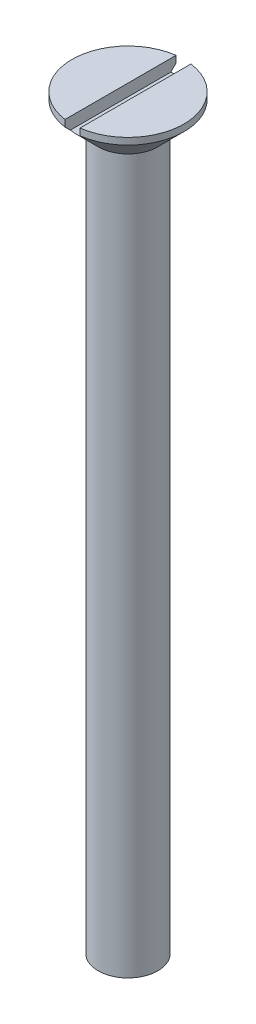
ISO-10303-21;
HEADER;
FILE_DESCRIPTION(('STEP AP214'),'2;1');
FILE_NAME('part.step','',(''),(''),'','','');
FILE_SCHEMA(('AUTOMOTIVE_DESIGN { 1 0 10303 214 1 1 1 1 }'));
ENDSEC;
DATA;
#1=APPLICATION_CONTEXT('core data for automotive mechanical design processes');
#2=APPLICATION_PROTOCOL_DEFINITION('international standard','automotive_design',2000,#1);
#3=PRODUCT_CONTEXT('',#1,'mechanical');
#4=PRODUCT('Part','Part','',(#3));
#5=PRODUCT_RELATED_PRODUCT_CATEGORY('part','',(#4));
#6=PRODUCT_DEFINITION_FORMATION('','',#4);
#7=PRODUCT_DEFINITION_CONTEXT('part definition',#1,'design');
#8=PRODUCT_DEFINITION('design','',#6,#7);
#9=PRODUCT_DEFINITION_SHAPE('','',#8);
#10=(LENGTH_UNIT() NAMED_UNIT(*) SI_UNIT(.MILLI.,.METRE.));
#11=(NAMED_UNIT(*) PLANE_ANGLE_UNIT() SI_UNIT($,.RADIAN.));
#12=(NAMED_UNIT(*) SI_UNIT($,.STERADIAN.) SOLID_ANGLE_UNIT());
#13=UNCERTAINTY_MEASURE_WITH_UNIT(LENGTH_MEASURE(1.E-05),#10,'distance_accuracy_value','');
#14=(GEOMETRIC_REPRESENTATION_CONTEXT(3) GLOBAL_UNCERTAINTY_ASSIGNED_CONTEXT((#13)) GLOBAL_UNIT_ASSIGNED_CONTEXT((#10,
#11,#12)) REPRESENTATION_CONTEXT('',''));
#15=CARTESIAN_POINT('',(0.,0.,0.));
#16=DIRECTION('',(0.,0.,1.));
#17=DIRECTION('',(1.,0.,0.));
#18=AXIS2_PLACEMENT_3D('',#15,#16,#17);
#19=CARTESIAN_POINT('',(0.,50.,0.));
#20=DIRECTION('',(0.,1.,0.));
#21=DIRECTION('',(-1.,0.,0.));
#22=AXIS2_PLACEMENT_3D('',#19,#20,#21);
#23=CYLINDRICAL_SURFACE('',#22,3.75);
#24=DIRECTION('',(0.,1.,0.));
#25=VECTOR('',#24,1.);
#26=CARTESIAN_POINT('',(-0.500000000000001,50.,3.71651718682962));
#27=LINE('',#26,#25);
#28=CARTESIAN_POINT('',(-0.500000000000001,50.,3.71651718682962));
#29=VERTEX_POINT('',#28);
#30=CARTESIAN_POINT('',(-0.500000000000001,49.55,3.71651718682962));
#31=VERTEX_POINT('',#30);
#32=EDGE_CURVE('E59',#29,#31,#27,.F.);
#33=ORIENTED_EDGE('',*,*,#32,.F.);
#34=CARTESIAN_POINT('',(0.,50.,0.));
#35=DIRECTION('',(0.,1.,0.));
#36=DIRECTION('',(-1.,0.,0.));
#37=AXIS2_PLACEMENT_3D('',#34,#35,#36);
#38=CIRCLE('',#37,3.75);
#39=CARTESIAN_POINT('',(-0.500000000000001,50.,-3.71651718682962));
#40=VERTEX_POINT('',#39);
#41=EDGE_CURVE('E107',#40,#29,#38,.T.);
#42=ORIENTED_EDGE('',*,*,#41,.F.);
#43=DIRECTION('',(0.,1.,0.));
#44=VECTOR('',#43,1.);
#45=CARTESIAN_POINT('',(-0.500000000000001,50.,-3.71651718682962));
#46=LINE('',#45,#44);
#47=CARTESIAN_POINT('',(-0.500000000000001,49.55,-3.71651718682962));
#48=VERTEX_POINT('',#47);
#49=EDGE_CURVE('E140',#48,#40,#46,.T.);
#50=ORIENTED_EDGE('',*,*,#49,.F.);
#51=CARTESIAN_POINT('',(0.,49.55,0.));
#52=DIRECTION('',(0.,1.,0.));
#53=DIRECTION('',(-1.,0.,0.));
#54=AXIS2_PLACEMENT_3D('',#51,#52,#53);
#55=CIRCLE('',#54,3.75);
#56=EDGE_CURVE('E106',#48,#31,#55,.T.);
#57=ORIENTED_EDGE('',*,*,#56,.T.);
#58=EDGE_LOOP('',(#33,#42,#50,#57));
#59=FACE_BOUND('',#58,.T.);
#60=ADVANCED_FACE('F36',(#59),#23,.T.);
#61=CARTESIAN_POINT('',(-3.75,50.,0.));
#62=DIRECTION('',(0.,1.,0.));
#63=DIRECTION('',(-1.,0.,0.));
#64=AXIS2_PLACEMENT_3D('',#61,#62,#63);
#65=PLANE('',#64);
#66=DIRECTION('',(0.,0.,1.));
#67=VECTOR('',#66,1.);
#68=CARTESIAN_POINT('',(-0.500000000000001,50.,0.));
#69=LINE('',#68,#67);
#70=EDGE_CURVE('E93',#40,#29,#69,.T.);
#71=ORIENTED_EDGE('',*,*,#70,.F.);
#72=ORIENTED_EDGE('',*,*,#41,.T.);
#73=EDGE_LOOP('',(#71,#72));
#74=FACE_BOUND('',#73,.T.);
#75=ADVANCED_FACE('F156',(#74),#65,.T.);
#76=CARTESIAN_POINT('',(0.,0.,0.));
#77=DIRECTION('',(0.,-1.,0.));
#78=DIRECTION('',(1.,0.,0.));
#79=AXIS2_PLACEMENT_3D('',#76,#77,#78);
#80=PLANE('',#79);
#81=CARTESIAN_POINT('',(0.,0.,0.));
#82=DIRECTION('',(0.,1.,0.));
#83=DIRECTION('',(-1.,0.,0.));
#84=AXIS2_PLACEMENT_3D('',#81,#82,#83);
#85=CIRCLE('',#84,2.);
#86=CARTESIAN_POINT('',(-2.,0.,0.));
#87=VERTEX_POINT('',#86);
#88=EDGE_CURVE('E94',#87,#87,#85,.T.);
#89=ORIENTED_EDGE('',*,*,#88,.F.);
#90=EDGE_LOOP('',(#89));
#91=FACE_BOUND('',#90,.T.);
#92=ADVANCED_FACE('F38',(#91),#80,.T.);
#93=CARTESIAN_POINT('',(0.,50.,0.));
#94=DIRECTION('',(0.,1.,0.));
#95=DIRECTION('',(-1.,0.,0.));
#96=AXIS2_PLACEMENT_3D('',#93,#94,#95);
#97=CYLINDRICAL_SURFACE('',#96,1.99999999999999);
#98=ORIENTED_EDGE('',*,*,#88,.T.);
#99=EDGE_LOOP('',(#98));
#100=FACE_BOUND('',#99,.T.);
#101=CARTESIAN_POINT('',(0.,47.8,0.));
#102=DIRECTION('',(0.,1.,0.));
#103=DIRECTION('',(-1.,0.,0.));
#104=AXIS2_PLACEMENT_3D('',#101,#102,#103);
#105=CIRCLE('',#104,1.99999999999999);
#106=CARTESIAN_POINT('',(-1.99999999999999,47.8,0.));
#107=VERTEX_POINT('',#106);
#108=EDGE_CURVE('E116',#107,#107,#105,.T.);
#109=ORIENTED_EDGE('',*,*,#108,.F.);
#110=EDGE_LOOP('',(#109));
#111=FACE_BOUND('',#110,.T.);
#112=ADVANCED_FACE('F161',(#100,#111),#97,.T.);
#113=CARTESIAN_POINT('',(0.,49.55,0.));
#114=DIRECTION('',(0.,1.,0.));
#115=DIRECTION('',(-1.,0.,0.));
#116=AXIS2_PLACEMENT_3D('',#113,#114,#115);
#117=CONICAL_SURFACE('',#116,3.75,0.785398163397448);
#118=CARTESIAN_POINT('',(-0.500000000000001,54.0550973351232,8.23994126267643));
#119=CARTESIAN_POINT('',(-0.500000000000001,53.7744963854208,7.95882009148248));
#120=CARTESIAN_POINT('',(-0.500000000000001,53.4939179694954,7.67767641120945));
#121=CARTESIAN_POINT('',(-0.500000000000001,52.9328309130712,7.11531119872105));
#122=CARTESIAN_POINT('',(-0.500000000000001,52.6523222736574,6.83408966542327));
#123=CARTESIAN_POINT('',(-0.500000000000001,52.0913157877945,6.27145196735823));
#124=CARTESIAN_POINT('',(-0.500000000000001,51.810817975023,5.99003576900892));
#125=CARTESIAN_POINT('',(-0.500000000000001,51.2499812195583,5.42705309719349));
#126=CARTESIAN_POINT('',(-0.500000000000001,50.9696422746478,5.14548662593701));
#127=CARTESIAN_POINT('',(-0.500000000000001,50.4011601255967,4.57400822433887));
#128=CARTESIAN_POINT('',(-0.500000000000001,50.1130242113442,4.28408904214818));
#129=CARTESIAN_POINT('',(-0.500000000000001,49.5371989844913,3.70378260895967));
#130=CARTESIAN_POINT('',(-0.500000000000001,49.249509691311,3.41339533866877));
#131=CARTESIAN_POINT('',(-0.500000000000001,48.8187346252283,2.97712474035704));
#132=CARTESIAN_POINT('',(-0.500000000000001,48.6752843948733,2.83160153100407));
#133=CARTESIAN_POINT('',(-0.500000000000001,48.3887721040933,2.54016851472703));
#134=CARTESIAN_POINT('',(-0.500000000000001,48.2457100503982,2.39425870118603));
#135=CARTESIAN_POINT('',(-0.500000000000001,47.9602376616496,2.10182340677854));
#136=CARTESIAN_POINT('',(-0.500000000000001,47.8178272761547,1.95529797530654));
#137=CARTESIAN_POINT('',(-0.500000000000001,47.6051397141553,1.73461874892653));
#138=CARTESIAN_POINT('',(-0.500000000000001,47.5343995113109,1.6609115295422));
#139=CARTESIAN_POINT('',(-0.500000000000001,47.3933772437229,1.51306045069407));
#140=CARTESIAN_POINT('',(-0.500000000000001,47.3230951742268,1.43891659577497));
#141=CARTESIAN_POINT('',(-0.500000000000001,47.2154772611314,1.32429753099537));
#142=CARTESIAN_POINT('',(-0.500000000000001,47.1778899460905,1.28405855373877));
#143=CARTESIAN_POINT('',(-0.500000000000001,47.1029855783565,1.2033283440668));
#144=CARTESIAN_POINT('',(-0.500000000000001,47.0656685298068,1.16283710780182));
#145=CARTESIAN_POINT('',(-0.500000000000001,46.9914890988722,1.08162799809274));
#146=CARTESIAN_POINT('',(-0.500000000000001,46.9546258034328,1.04091095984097));
#147=CARTESIAN_POINT('',(-0.500000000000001,46.8813939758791,0.959035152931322));
#148=CARTESIAN_POINT('',(-0.500000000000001,46.8450254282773,0.917876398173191));
#149=CARTESIAN_POINT('',(-0.500000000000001,46.7629864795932,0.823429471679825));
#150=CARTESIAN_POINT('',(-0.500000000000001,46.7175384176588,0.769947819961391));
#151=CARTESIAN_POINT('',(-0.500000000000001,46.628333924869,0.661160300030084));
#152=CARTESIAN_POINT('',(-0.500000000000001,46.5845858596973,0.605847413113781));
#153=CARTESIAN_POINT('',(-0.500000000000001,46.5215167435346,0.520527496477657));
#154=CARTESIAN_POINT('',(-0.500000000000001,46.5008215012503,0.491543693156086));
#155=CARTESIAN_POINT('',(-0.500000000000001,46.4608054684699,0.432592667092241));
#156=CARTESIAN_POINT('',(-0.500000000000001,46.4414859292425,0.402624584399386));
#157=CARTESIAN_POINT('',(-0.500000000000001,46.4050500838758,0.341587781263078));
#158=CARTESIAN_POINT('',(-0.500000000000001,46.3879217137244,0.310526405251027));
#159=CARTESIAN_POINT('',(-0.500000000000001,46.3569217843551,0.246848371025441));
#160=CARTESIAN_POINT('',(-0.500000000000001,46.3430433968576,0.214235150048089));
#161=CARTESIAN_POINT('',(-0.500000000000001,46.3203209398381,0.147349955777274));
#162=CARTESIAN_POINT('',(-0.500000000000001,46.311456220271,0.113085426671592));
#163=CARTESIAN_POINT('',(-0.500000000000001,46.300743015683,0.0435910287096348));
#164=CARTESIAN_POINT('',(-0.500000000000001,46.2988539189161,0.00836795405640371));
#165=CARTESIAN_POINT('',(-0.500000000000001,46.302564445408,-0.0616477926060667));
#166=CARTESIAN_POINT('',(-0.500000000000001,46.3081644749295,-0.0964404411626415));
#167=CARTESIAN_POINT('',(-0.500000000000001,46.3253551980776,-0.16464023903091));
#168=CARTESIAN_POINT('',(-0.500000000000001,46.3369850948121,-0.198036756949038));
#169=CARTESIAN_POINT('',(-0.500000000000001,46.3680775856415,-0.272322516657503));
#170=CARTESIAN_POINT('',(-0.500000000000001,46.3888261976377,-0.312650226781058));
#171=CARTESIAN_POINT('',(-0.500000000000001,46.4340431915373,-0.391203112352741));
#172=CARTESIAN_POINT('',(-0.500000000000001,46.4585213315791,-0.429422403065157));
#173=CARTESIAN_POINT('',(-0.500000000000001,46.5098462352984,-0.504617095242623));
#174=CARTESIAN_POINT('',(-0.500000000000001,46.5367087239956,-0.54158161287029));
#175=CARTESIAN_POINT('',(-0.500000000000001,46.5917840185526,-0.614398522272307));
#176=CARTESIAN_POINT('',(-0.500000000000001,46.6199949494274,-0.650252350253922));
#177=CARTESIAN_POINT('',(-0.500000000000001,46.6820466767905,-0.727048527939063));
#178=CARTESIAN_POINT('',(-0.500000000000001,46.7160505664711,-0.767858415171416));
#179=CARTESIAN_POINT('',(-0.500000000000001,46.784878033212,-0.848783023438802));
#180=CARTESIAN_POINT('',(-0.500000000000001,46.8197016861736,-0.888897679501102));
#181=CARTESIAN_POINT('',(-0.500000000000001,46.9250255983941,-1.0085303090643));
#182=CARTESIAN_POINT('',(-0.500000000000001,46.996358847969,-1.08731295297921));
#183=CARTESIAN_POINT('',(-0.500000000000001,47.1402844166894,-1.24390110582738));
#184=CARTESIAN_POINT('',(-0.500000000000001,47.2128782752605,-1.3217051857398));
#185=CARTESIAN_POINT('',(-0.500000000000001,47.3587657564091,-1.47662793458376));
#186=CARTESIAN_POINT('',(-0.500000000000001,47.4320592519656,-1.55374672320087));
#187=CARTESIAN_POINT('',(-0.500000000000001,47.5786249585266,-1.70704564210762));
#188=CARTESIAN_POINT('',(-0.500000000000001,47.6518942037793,-1.78322861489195));
#189=CARTESIAN_POINT('',(-0.500000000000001,47.7987470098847,-1.93529767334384));
#190=CARTESIAN_POINT('',(-0.500000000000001,47.8723305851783,-2.01118374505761));
#191=CARTESIAN_POINT('',(-0.500000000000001,48.0933074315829,-2.23841837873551));
#192=CARTESIAN_POINT('',(-0.500000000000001,48.2410279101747,-2.38944851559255));
#193=CARTESIAN_POINT('',(-0.500000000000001,48.6222549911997,-2.77799092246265));
#194=CARTESIAN_POINT('',(-0.500000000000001,48.8561141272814,-3.01515671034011));
#195=CARTESIAN_POINT('',(-0.500000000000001,49.3243992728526,-3.48893097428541));
#196=CARTESIAN_POINT('',(-0.500000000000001,49.5588252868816,-3.72553944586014));
#197=CARTESIAN_POINT('',(-0.500000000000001,50.0280717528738,-4.19850777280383));
#198=CARTESIAN_POINT('',(-0.500000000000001,50.262892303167,-4.43486753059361));
#199=CARTESIAN_POINT('',(-0.500000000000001,50.7327316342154,-4.90738857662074));
#200=CARTESIAN_POINT('',(-0.500000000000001,50.9677504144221,-5.14354986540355));
#201=CARTESIAN_POINT('',(-0.500000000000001,51.6779302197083,-5.85679532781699));
#202=CARTESIAN_POINT('',(-0.500000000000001,52.15328862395,-6.33368295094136));
#203=CARTESIAN_POINT('',(-0.500000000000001,52.8664398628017,-7.04874824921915));
#204=CARTESIAN_POINT('',(-0.500000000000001,53.1041376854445,-7.28702073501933));
#205=CARTESIAN_POINT('',(-0.500000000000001,53.5795832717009,-7.76351539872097));
#206=CARTESIAN_POINT('',(-0.500000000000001,53.8173310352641,-8.00173757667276));
#207=CARTESIAN_POINT('',(-0.500000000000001,54.0550973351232,-8.23994126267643));
#208=B_SPLINE_CURVE_WITH_KNOTS('',3,(#118,#119,#120,#121,#122,#123,#124,#125,#126,#127,#128,
#129,#130,#131,#132,#133,#134,#135,#136,#137,#138,#139,#140,#141,#142,#143,#144,#145,#146,#147,
#148,#149,#150,#151,#152,#153,#154,#155,#156,#157,#158,#159,#160,#161,#162,#163,#164,#165,#166,
#167,#168,#169,#170,#171,#172,#173,#174,#175,#176,#177,#178,#179,#180,#181,#182,#183,#184,#185,
#186,#187,#188,#189,#190,#191,#192,#193,#194,#195,#196,#197,#198,#199,#200,#201,#202,#203,#204,
#205,#206,#207),.UNSPECIFIED.,.F.,.F.,(4,2,2,2,2,2,2,2,2,2,2,2,2,2,2,2,2,2,2,2,2,2,2,2,2,2,2,2,
2,2,2,2,2,2,2,2,2,2,2,2,2,2,2,2,4),(0.,1.19159309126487,2.3832036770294,3.57520486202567,
4.76718897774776,5.99343470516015,7.21973233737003,7.83275280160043,8.44578382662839,
9.05876656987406,9.36524937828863,9.67172900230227,9.83691841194,10.0021103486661,
10.1668833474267,10.3316511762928,10.5421874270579,10.7536543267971,10.8604696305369,
10.9673808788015,11.0736755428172,11.1797448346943,11.2853740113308,11.3903872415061,
11.4954061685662,11.6011165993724,11.7368103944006,11.8728655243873,12.0098961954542,
12.1467415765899,12.3060839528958,12.4654411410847,12.7842491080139,13.1034784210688,
13.4226508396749,13.7397460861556,14.0568560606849,14.690638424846,15.6898557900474,
16.6890811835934,17.688610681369,18.6881374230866,20.7081586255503,21.7178448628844,
22.7275300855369),.UNSPECIFIED.);
#209=CARTESIAN_POINT('',(-0.500000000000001,49.2,3.36303434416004));
#210=VERTEX_POINT('',#209);
#211=EDGE_CURVE('E112',#31,#210,#208,.T.);
#212=ORIENTED_EDGE('',*,*,#211,.F.);
#213=ORIENTED_EDGE('',*,*,#56,.F.);
#214=CARTESIAN_POINT('',(-0.500000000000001,49.2,-3.36303434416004));
#215=VERTEX_POINT('',#214);
#216=EDGE_CURVE('E134',#215,#48,#208,.T.);
#217=ORIENTED_EDGE('',*,*,#216,.F.);
#218=CARTESIAN_POINT('',(0.,49.2,0.));
#219=DIRECTION('',(0.,-1.,0.));
#220=DIRECTION('',(0.,0.,-1.));
#221=AXIS2_PLACEMENT_3D('',#218,#219,#220);
#222=CIRCLE('',#221,3.39999999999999);
#223=CARTESIAN_POINT('',(0.500000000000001,49.2,-3.36303434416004));
#224=VERTEX_POINT('',#223);
#225=EDGE_CURVE('E40',#224,#215,#222,.F.);
#226=ORIENTED_EDGE('',*,*,#225,.F.);
#227=CARTESIAN_POINT('',(0.500000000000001,54.0550973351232,-8.23994126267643));
#228=CARTESIAN_POINT('',(0.500000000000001,53.7744963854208,-7.95882009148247));
#229=CARTESIAN_POINT('',(0.500000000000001,53.4939179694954,-7.67767641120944));
#230=CARTESIAN_POINT('',(0.500000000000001,52.9328309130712,-7.11531119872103));
#231=CARTESIAN_POINT('',(0.500000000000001,52.6523222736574,-6.83408966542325));
#232=CARTESIAN_POINT('',(0.500000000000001,52.0913157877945,-6.27145196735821));
#233=CARTESIAN_POINT('',(0.500000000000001,51.8108179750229,-5.9900357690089));
#234=CARTESIAN_POINT('',(0.500000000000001,51.2499812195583,-5.42705309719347));
#235=CARTESIAN_POINT('',(0.500000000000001,50.9696422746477,-5.14548662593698));
#236=CARTESIAN_POINT('',(0.500000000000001,50.4011601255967,-4.57400822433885));
#237=CARTESIAN_POINT('',(0.500000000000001,50.1130242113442,-4.28408904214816));
#238=CARTESIAN_POINT('',(0.500000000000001,49.5371989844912,-3.70378260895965));
#239=CARTESIAN_POINT('',(0.500000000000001,49.2495096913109,-3.41339533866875));
#240=CARTESIAN_POINT('',(0.500000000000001,48.8187346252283,-2.97712474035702));
#241=CARTESIAN_POINT('',(0.500000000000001,48.6752843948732,-2.83160153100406));
#242=CARTESIAN_POINT('',(0.500000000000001,48.3887721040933,-2.54016851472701));
#243=CARTESIAN_POINT('',(0.500000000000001,48.2457100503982,-2.39425870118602));
#244=CARTESIAN_POINT('',(0.500000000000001,47.9602376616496,-2.10182340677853));
#245=CARTESIAN_POINT('',(0.500000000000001,47.8178272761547,-1.95529797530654));
#246=CARTESIAN_POINT('',(0.500000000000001,47.6051397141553,-1.73461874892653));
#247=CARTESIAN_POINT('',(0.500000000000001,47.5343995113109,-1.6609115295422));
#248=CARTESIAN_POINT('',(0.500000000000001,47.3933772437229,-1.51306045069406));
#249=CARTESIAN_POINT('',(0.500000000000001,47.3230951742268,-1.43891659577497));
#250=CARTESIAN_POINT('',(0.500000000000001,47.2154772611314,-1.32429753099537));
#251=CARTESIAN_POINT('',(0.500000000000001,47.1778899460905,-1.28405855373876));
#252=CARTESIAN_POINT('',(0.500000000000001,47.1029855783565,-1.20332834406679));
#253=CARTESIAN_POINT('',(0.500000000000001,47.0656685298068,-1.16283710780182));
#254=CARTESIAN_POINT('',(0.500000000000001,46.9914890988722,-1.08162799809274));
#255=CARTESIAN_POINT('',(0.500000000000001,46.9546258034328,-1.04091095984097));
#256=CARTESIAN_POINT('',(0.500000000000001,46.8813939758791,-0.959035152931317));
#257=CARTESIAN_POINT('',(0.500000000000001,46.8450254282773,-0.917876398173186));
#258=CARTESIAN_POINT('',(0.500000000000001,46.7629864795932,-0.82342947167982));
#259=CARTESIAN_POINT('',(0.500000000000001,46.7175384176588,-0.769947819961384));
#260=CARTESIAN_POINT('',(0.500000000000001,46.628333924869,-0.661160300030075));
#261=CARTESIAN_POINT('',(0.500000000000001,46.5845858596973,-0.605847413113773));
#262=CARTESIAN_POINT('',(0.500000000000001,46.5215167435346,-0.520527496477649));
#263=CARTESIAN_POINT('',(0.500000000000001,46.5008215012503,-0.491543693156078));
#264=CARTESIAN_POINT('',(0.500000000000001,46.4608054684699,-0.432592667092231));
#265=CARTESIAN_POINT('',(0.500000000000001,46.4414859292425,-0.402624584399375));
#266=CARTESIAN_POINT('',(0.500000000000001,46.4050500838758,-0.341587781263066));
#267=CARTESIAN_POINT('',(0.500000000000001,46.3879217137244,-0.310526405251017));
#268=CARTESIAN_POINT('',(0.500000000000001,46.3569217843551,-0.246848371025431));
#269=CARTESIAN_POINT('',(0.500000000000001,46.3430433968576,-0.21423515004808));
#270=CARTESIAN_POINT('',(0.500000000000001,46.3203209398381,-0.147349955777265));
#271=CARTESIAN_POINT('',(0.500000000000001,46.3114562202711,-0.113085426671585));
#272=CARTESIAN_POINT('',(0.500000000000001,46.300743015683,-0.0435910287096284));
#273=CARTESIAN_POINT('',(0.500000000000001,46.2988539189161,-0.00836795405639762));
#274=CARTESIAN_POINT('',(0.500000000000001,46.302564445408,0.0616477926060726));
#275=CARTESIAN_POINT('',(0.500000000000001,46.3081644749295,0.0964404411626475));
#276=CARTESIAN_POINT('',(0.500000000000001,46.3253551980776,0.164640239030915));
#277=CARTESIAN_POINT('',(0.500000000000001,46.3369850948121,0.198036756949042));
#278=CARTESIAN_POINT('',(0.500000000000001,46.3680775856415,0.272322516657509));
#279=CARTESIAN_POINT('',(0.500000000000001,46.3888261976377,0.312650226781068));
#280=CARTESIAN_POINT('',(0.500000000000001,46.4340431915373,0.391203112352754));
#281=CARTESIAN_POINT('',(0.500000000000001,46.4585213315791,0.429422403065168));
#282=CARTESIAN_POINT('',(0.500000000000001,46.5098462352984,0.504617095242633));
#283=CARTESIAN_POINT('',(0.500000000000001,46.5367087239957,0.541581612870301));
#284=CARTESIAN_POINT('',(0.500000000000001,46.5917840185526,0.614398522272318));
#285=CARTESIAN_POINT('',(0.500000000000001,46.6199949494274,0.650252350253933));
#286=CARTESIAN_POINT('',(0.500000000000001,46.6820466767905,0.727048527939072));
#287=CARTESIAN_POINT('',(0.500000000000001,46.7160505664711,0.767858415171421));
#288=CARTESIAN_POINT('',(0.500000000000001,46.784878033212,0.848783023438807));
#289=CARTESIAN_POINT('',(0.500000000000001,46.8197016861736,0.888897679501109));
#290=CARTESIAN_POINT('',(0.500000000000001,46.9250255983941,1.00853030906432));
#291=CARTESIAN_POINT('',(0.500000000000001,46.996358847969,1.08731295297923));
#292=CARTESIAN_POINT('',(0.500000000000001,47.1402844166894,1.2439011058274));
#293=CARTESIAN_POINT('',(0.500000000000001,47.2128782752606,1.32170518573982));
#294=CARTESIAN_POINT('',(0.500000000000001,47.3587657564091,1.47662793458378));
#295=CARTESIAN_POINT('',(0.500000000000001,47.4320592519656,1.55374672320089));
#296=CARTESIAN_POINT('',(0.500000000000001,47.5786249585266,1.70704564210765));
#297=CARTESIAN_POINT('',(0.500000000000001,47.6518942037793,1.78322861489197));
#298=CARTESIAN_POINT('',(0.500000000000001,47.7987470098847,1.93529767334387));
#299=CARTESIAN_POINT('',(0.500000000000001,47.8723305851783,2.01118374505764));
#300=CARTESIAN_POINT('',(0.500000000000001,48.0933074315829,2.23841837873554));
#301=CARTESIAN_POINT('',(0.500000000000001,48.2410279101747,2.38944851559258));
#302=CARTESIAN_POINT('',(0.500000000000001,48.6222549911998,2.77799092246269));
#303=CARTESIAN_POINT('',(0.500000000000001,48.8561141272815,3.01515671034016));
#304=CARTESIAN_POINT('',(0.500000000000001,49.3243992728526,3.48893097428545));
#305=CARTESIAN_POINT('',(0.500000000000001,49.5588252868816,3.72553944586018));
#306=CARTESIAN_POINT('',(0.500000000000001,50.0280717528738,4.19850777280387));
#307=CARTESIAN_POINT('',(0.500000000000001,50.2628923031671,4.43486753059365));
#308=CARTESIAN_POINT('',(0.500000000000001,50.7327316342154,4.90738857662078));
#309=CARTESIAN_POINT('',(0.500000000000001,50.9677504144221,5.1435498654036));
#310=CARTESIAN_POINT('',(0.500000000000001,51.6779302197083,5.85679532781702));
#311=CARTESIAN_POINT('',(0.500000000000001,52.15328862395,6.33368295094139));
#312=CARTESIAN_POINT('',(0.500000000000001,52.8664398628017,7.04874824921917));
#313=CARTESIAN_POINT('',(0.500000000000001,53.1041376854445,7.28702073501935));
#314=CARTESIAN_POINT('',(0.500000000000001,53.579583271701,7.76351539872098));
#315=CARTESIAN_POINT('',(0.500000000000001,53.8173310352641,8.00173757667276));
#316=CARTESIAN_POINT('',(0.500000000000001,54.0550973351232,8.23994126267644));
#317=B_SPLINE_CURVE_WITH_KNOTS('',3,(#227,#228,#229,#230,#231,#232,#233,#234,#235,#236,#237,
#238,#239,#240,#241,#242,#243,#244,#245,#246,#247,#248,#249,#250,#251,#252,#253,#254,#255,#256,
#257,#258,#259,#260,#261,#262,#263,#264,#265,#266,#267,#268,#269,#270,#271,#272,#273,#274,#275,
#276,#277,#278,#279,#280,#281,#282,#283,#284,#285,#286,#287,#288,#289,#290,#291,#292,#293,#294,
#295,#296,#297,#298,#299,#300,#301,#302,#303,#304,#305,#306,#307,#308,#309,#310,#311,#312,#313,
#314,#315,#316),.UNSPECIFIED.,.F.,.F.,(4,2,2,2,2,2,2,2,2,2,2,2,2,2,2,2,2,2,2,2,2,2,2,2,2,2,2,2,
2,2,2,2,2,2,2,2,2,2,2,2,2,2,2,2,4),(0.,1.19159309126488,2.38320367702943,3.5752048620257,
4.7671889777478,5.99343470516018,7.21973233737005,7.83275280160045,8.4457838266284,
9.05876656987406,9.36524937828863,9.67172900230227,9.83691841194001,10.0021103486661,
10.1668833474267,10.3316511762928,10.5421874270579,10.7536543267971,10.860469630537,
10.9673808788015,11.0736755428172,11.1797448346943,11.2853740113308,11.3903872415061,
11.4954061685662,11.6011165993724,11.7368103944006,11.8728655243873,12.0098961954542,
12.1467415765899,12.3060839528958,12.4654411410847,12.7842491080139,13.1034784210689,
13.4226508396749,13.7397460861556,14.0568560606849,14.6906384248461,15.6898557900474,
16.6890811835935,17.6886106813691,18.6881374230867,20.7081586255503,21.7178448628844,
22.7275300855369),.UNSPECIFIED.);
#318=CARTESIAN_POINT('',(0.500000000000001,49.55,-3.71651718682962));
#319=VERTEX_POINT('',#318);
#320=EDGE_CURVE('E102',#319,#224,#317,.T.);
#321=ORIENTED_EDGE('',*,*,#320,.F.);
#322=CARTESIAN_POINT('',(0.500000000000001,49.55,3.71651718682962));
#323=VERTEX_POINT('',#322);
#324=EDGE_CURVE('E101',#323,#319,#55,.T.);
#325=ORIENTED_EDGE('',*,*,#324,.F.);
#326=CARTESIAN_POINT('',(0.500000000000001,49.2,3.36303434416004));
#327=VERTEX_POINT('',#326);
#328=EDGE_CURVE('E103',#327,#323,#317,.T.);
#329=ORIENTED_EDGE('',*,*,#328,.F.);
#330=EDGE_CURVE('E11',#210,#327,#222,.F.);
#331=ORIENTED_EDGE('',*,*,#330,.F.);
#332=EDGE_LOOP('',(#212,#213,#217,#226,#321,#325,#329,#331));
#333=FACE_BOUND('',#332,.T.);
#334=ORIENTED_EDGE('',*,*,#108,.T.);
#335=EDGE_LOOP('',(#334));
#336=FACE_BOUND('',#335,.T.);
#337=ADVANCED_FACE('F138',(#333,#336),#117,.T.);
#338=DIRECTION('',(0.,1.,0.));
#339=VECTOR('',#338,1.);
#340=CARTESIAN_POINT('',(0.500000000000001,50.,-3.71651718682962));
#341=LINE('',#340,#339);
#342=CARTESIAN_POINT('',(0.500000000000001,50.,-3.71651718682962));
#343=VERTEX_POINT('',#342);
#344=EDGE_CURVE('E88',#343,#319,#341,.F.);
#345=ORIENTED_EDGE('',*,*,#344,.F.);
#346=CARTESIAN_POINT('',(0.500000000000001,50.,3.71651718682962));
#347=VERTEX_POINT('',#346);
#348=EDGE_CURVE('E99',#347,#343,#38,.T.);
#349=ORIENTED_EDGE('',*,*,#348,.F.);
#350=DIRECTION('',(0.,1.,0.));
#351=VECTOR('',#350,1.);
#352=CARTESIAN_POINT('',(0.500000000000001,50.,3.71651718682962));
#353=LINE('',#352,#351);
#354=EDGE_CURVE('E51',#323,#347,#353,.T.);
#355=ORIENTED_EDGE('',*,*,#354,.F.);
#356=ORIENTED_EDGE('',*,*,#324,.T.);
#357=EDGE_LOOP('',(#345,#349,#355,#356));
#358=FACE_BOUND('',#357,.T.);
#359=ADVANCED_FACE('F98',(#358),#23,.T.);
#360=DIRECTION('',(0.,0.,-1.));
#361=VECTOR('',#360,1.);
#362=CARTESIAN_POINT('',(0.500000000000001,50.,0.));
#363=LINE('',#362,#361);
#364=EDGE_CURVE('E85',#347,#343,#363,.T.);
#365=ORIENTED_EDGE('',*,*,#364,.F.);
#366=ORIENTED_EDGE('',*,*,#348,.T.);
#367=EDGE_LOOP('',(#365,#366));
#368=FACE_BOUND('',#367,.T.);
#369=ADVANCED_FACE('F105',(#368),#65,.T.);
#370=CARTESIAN_POINT('',(-0.500000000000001,50.,-3.75));
#371=DIRECTION('',(-1.,0.,0.));
#372=DIRECTION('',(0.,0.,1.));
#373=AXIS2_PLACEMENT_3D('',#370,#371,#372);
#374=PLANE('',#373);
#375=ORIENTED_EDGE('',*,*,#211,.T.);
#376=DIRECTION('',(0.,0.,1.));
#377=VECTOR('',#376,1.);
#378=CARTESIAN_POINT('',(-0.500000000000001,49.2,-3.75));
#379=LINE('',#378,#377);
#380=EDGE_CURVE('E127',#215,#210,#379,.T.);
#381=ORIENTED_EDGE('',*,*,#380,.F.);
#382=ORIENTED_EDGE('',*,*,#216,.T.);
#383=ORIENTED_EDGE('',*,*,#49,.T.);
#384=ORIENTED_EDGE('',*,*,#70,.T.);
#385=ORIENTED_EDGE('',*,*,#32,.T.);
#386=EDGE_LOOP('',(#375,#381,#382,#383,#384,#385));
#387=FACE_BOUND('',#386,.T.);
#388=ADVANCED_FACE('F133',(#387),#374,.F.);
#389=CARTESIAN_POINT('',(0.500000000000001,50.,-3.75));
#390=DIRECTION('',(1.,0.,0.));
#391=DIRECTION('',(0.,0.,-1.));
#392=AXIS2_PLACEMENT_3D('',#389,#390,#391);
#393=PLANE('',#392);
#394=ORIENTED_EDGE('',*,*,#320,.T.);
#395=DIRECTION('',(0.,0.,1.));
#396=VECTOR('',#395,1.);
#397=CARTESIAN_POINT('',(0.500000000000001,49.2,-3.75));
#398=LINE('',#397,#396);
#399=EDGE_CURVE('E130',#224,#327,#398,.T.);
#400=ORIENTED_EDGE('',*,*,#399,.T.);
#401=ORIENTED_EDGE('',*,*,#328,.T.);
#402=ORIENTED_EDGE('',*,*,#354,.T.);
#403=ORIENTED_EDGE('',*,*,#364,.T.);
#404=ORIENTED_EDGE('',*,*,#344,.T.);
#405=EDGE_LOOP('',(#394,#400,#401,#402,#403,#404));
#406=FACE_BOUND('',#405,.T.);
#407=ADVANCED_FACE('F87',(#406),#393,.F.);
#408=CARTESIAN_POINT('',(-0.500000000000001,49.2,-3.75));
#409=DIRECTION('',(0.,-1.,0.));
#410=DIRECTION('',(0.,0.,-1.));
#411=AXIS2_PLACEMENT_3D('',#408,#409,#410);
#412=PLANE('',#411);
#413=ORIENTED_EDGE('',*,*,#330,.T.);
#414=ORIENTED_EDGE('',*,*,#399,.F.);
#415=ORIENTED_EDGE('',*,*,#225,.T.);
#416=ORIENTED_EDGE('',*,*,#380,.T.);
#417=EDGE_LOOP('',(#413,#414,#415,#416));
#418=FACE_BOUND('',#417,.T.);
#419=ADVANCED_FACE('F126',(#418),#412,.F.);
#420=CLOSED_SHELL('',(#60,#75,#92,#112,#337,#359,#369,#388,#407,#419));
#421=MANIFOLD_SOLID_BREP('B2',#420);
#422=ADVANCED_BREP_SHAPE_REPRESENTATION('',(#18,#421),#14);
#423=SHAPE_DEFINITION_REPRESENTATION(#9,#422);
ENDSEC;
END-ISO-10303-21;
